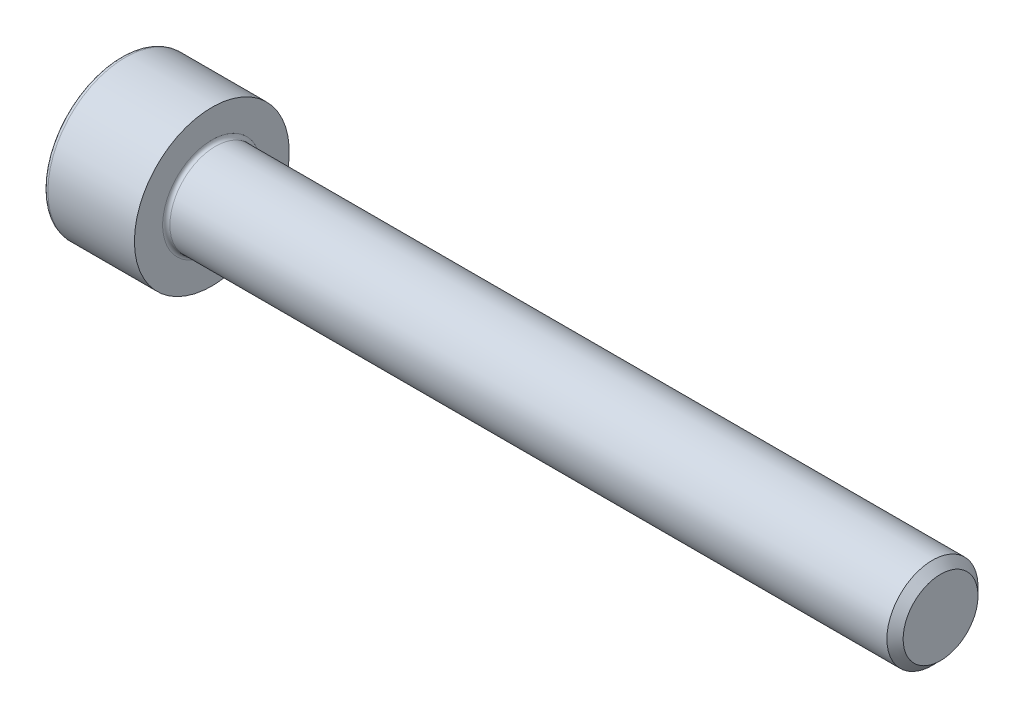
ISO-10303-21;
HEADER;
FILE_DESCRIPTION(('STEP AP214'),'2;1');
FILE_NAME('part.step','',(''),(''),'','','');
FILE_SCHEMA(('AUTOMOTIVE_DESIGN { 1 0 10303 214 1 1 1 1 }'));
ENDSEC;
DATA;
#1=APPLICATION_CONTEXT('core data for automotive mechanical design processes');
#2=APPLICATION_PROTOCOL_DEFINITION('international standard','automotive_design',2000,#1);
#3=PRODUCT_CONTEXT('',#1,'mechanical');
#4=PRODUCT('Part','Part','',(#3));
#5=PRODUCT_RELATED_PRODUCT_CATEGORY('part','',(#4));
#6=PRODUCT_DEFINITION_FORMATION('','',#4);
#7=PRODUCT_DEFINITION_CONTEXT('part definition',#1,'design');
#8=PRODUCT_DEFINITION('design','',#6,#7);
#9=PRODUCT_DEFINITION_SHAPE('','',#8);
#10=(LENGTH_UNIT() NAMED_UNIT(*) SI_UNIT(.MILLI.,.METRE.));
#11=(NAMED_UNIT(*) PLANE_ANGLE_UNIT() SI_UNIT($,.RADIAN.));
#12=(NAMED_UNIT(*) SI_UNIT($,.STERADIAN.) SOLID_ANGLE_UNIT());
#13=UNCERTAINTY_MEASURE_WITH_UNIT(LENGTH_MEASURE(1.E-05),#10,'distance_accuracy_value','');
#14=(GEOMETRIC_REPRESENTATION_CONTEXT(3) GLOBAL_UNCERTAINTY_ASSIGNED_CONTEXT((#13)) GLOBAL_UNIT_ASSIGNED_CONTEXT((#10,
#11,#12)) REPRESENTATION_CONTEXT('',''));
#15=CARTESIAN_POINT('',(0.,0.,0.));
#16=DIRECTION('',(0.,0.,1.));
#17=DIRECTION('',(1.,0.,0.));
#18=AXIS2_PLACEMENT_3D('',#15,#16,#17);
#19=CARTESIAN_POINT('',(0.,0.,0.));
#20=DIRECTION('',(-0.999999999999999,0.,0.));
#21=DIRECTION('',(0.,0.,1.));
#22=AXIS2_PLACEMENT_3D('',#19,#20,#21);
#23=PLANE('',#22);
#24=DIRECTION('',(0.,-0.499999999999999,0.86602540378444));
#25=VECTOR('',#24,1.);
#26=CARTESIAN_POINT('',(0.,2.35789849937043,0.));
#27=LINE('',#26,#25);
#28=CARTESIAN_POINT('',(0.,2.35789849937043,0.));
#29=VERTEX_POINT('',#28);
#30=CARTESIAN_POINT('',(0.,1.17894924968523,2.04199999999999));
#31=VERTEX_POINT('',#30);
#32=EDGE_CURVE('E263',#29,#31,#27,.T.);
#33=ORIENTED_EDGE('',*,*,#32,.T.);
#34=DIRECTION('',(0.,1.,0.));
#35=VECTOR('',#34,1.);
#36=CARTESIAN_POINT('',(0.,-1.17894924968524,2.04200000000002));
#37=LINE('',#36,#35);
#38=CARTESIAN_POINT('',(0.,-1.17894924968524,2.04200000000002));
#39=VERTEX_POINT('',#38);
#40=EDGE_CURVE('E124',#39,#31,#37,.T.);
#41=ORIENTED_EDGE('',*,*,#40,.F.);
#42=DIRECTION('',(0.,-0.500000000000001,-0.866025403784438));
#43=VECTOR('',#42,1.);
#44=CARTESIAN_POINT('',(0.,-1.17894924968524,2.04200000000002));
#45=LINE('',#44,#43);
#46=CARTESIAN_POINT('',(0.,-2.35789849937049,0.));
#47=VERTEX_POINT('',#46);
#48=EDGE_CURVE('E266',#39,#47,#45,.T.);
#49=ORIENTED_EDGE('',*,*,#48,.T.);
#50=DIRECTION('',(0.,0.499999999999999,-0.866025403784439));
#51=VECTOR('',#50,1.);
#52=CARTESIAN_POINT('',(0.,-2.35789849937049,0.));
#53=LINE('',#52,#51);
#54=CARTESIAN_POINT('',(0.,-1.17894924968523,-2.042));
#55=VERTEX_POINT('',#54);
#56=EDGE_CURVE('E269',#47,#55,#53,.T.);
#57=ORIENTED_EDGE('',*,*,#56,.T.);
#58=DIRECTION('',(0.,-1.,0.));
#59=VECTOR('',#58,1.);
#60=CARTESIAN_POINT('',(0.,1.1789492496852,-2.042));
#61=LINE('',#60,#59);
#62=CARTESIAN_POINT('',(0.,1.1789492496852,-2.042));
#63=VERTEX_POINT('',#62);
#64=EDGE_CURVE('E272',#63,#55,#61,.T.);
#65=ORIENTED_EDGE('',*,*,#64,.F.);
#66=DIRECTION('',(0.,-0.500000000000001,-0.866025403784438));
#67=VECTOR('',#66,1.);
#68=CARTESIAN_POINT('',(0.,2.35789849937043,0.));
#69=LINE('',#68,#67);
#70=EDGE_CURVE('E119',#29,#63,#69,.T.);
#71=ORIENTED_EDGE('',*,*,#70,.F.);
#72=EDGE_LOOP('',(#33,#41,#49,#57,#65,#71));
#73=FACE_BOUND('',#72,.T.);
#74=CARTESIAN_POINT('',(0.,0.,0.));
#75=DIRECTION('',(-0.999999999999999,0.,0.));
#76=DIRECTION('',(0.,0.,1.));
#77=AXIS2_PLACEMENT_3D('',#74,#75,#76);
#78=CIRCLE('',#77,4.);
#79=CARTESIAN_POINT('',(0.,0.,4.));
#80=VERTEX_POINT('',#79);
#81=EDGE_CURVE('E40',#80,#80,#78,.T.);
#82=ORIENTED_EDGE('',*,*,#81,.T.);
#83=EDGE_LOOP('',(#82));
#84=FACE_BOUND('',#83,.T.);
#85=ADVANCED_FACE('F32',(#73,#84),#23,.T.);
#86=CARTESIAN_POINT('',(-31.7499999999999,0.,0.));
#87=DIRECTION('',(-0.999999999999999,0.,0.));
#88=DIRECTION('',(0.,0.,1.));
#89=AXIS2_PLACEMENT_3D('',#86,#87,#88);
#90=CYLINDRICAL_SURFACE('',#89,4.25);
#91=CARTESIAN_POINT('',(0.250000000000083,0.,0.));
#92=DIRECTION('',(-0.999999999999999,0.,0.));
#93=DIRECTION('',(0.,0.,1.));
#94=AXIS2_PLACEMENT_3D('',#91,#92,#93);
#95=CIRCLE('',#94,4.25);
#96=CARTESIAN_POINT('',(0.250000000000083,0.,4.25000000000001));
#97=VERTEX_POINT('',#96);
#98=EDGE_CURVE('E11',#97,#97,#95,.F.);
#99=CARTESIAN_POINT('',(4.99999999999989,0.,0.));
#100=DIRECTION('',(-0.999999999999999,0.,0.));
#101=DIRECTION('',(0.,0.,1.));
#102=AXIS2_PLACEMENT_3D('',#99,#100,#101);
#103=CIRCLE('',#102,4.25);
#104=CARTESIAN_POINT('',(4.9999999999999,0.,4.25000000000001));
#105=VERTEX_POINT('',#104);
#106=EDGE_CURVE('E142',#105,#105,#103,.T.);
#107=CARTESIAN_POINT('',(0.250000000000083,0.,4.25000000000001));
#108=CARTESIAN_POINT('',(0.299479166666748,0.,4.25000000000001));
#109=CARTESIAN_POINT('',(0.348958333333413,0.,4.25000000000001));
#110=CARTESIAN_POINT('',(0.447916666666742,0.,4.25000000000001));
#111=CARTESIAN_POINT('',(0.497395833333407,0.,4.25000000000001));
#112=CARTESIAN_POINT('',(0.596354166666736,0.,4.25000000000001));
#113=CARTESIAN_POINT('',(0.645833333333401,0.,4.25000000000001));
#114=CARTESIAN_POINT('',(0.74479166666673,0.,4.25000000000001));
#115=CARTESIAN_POINT('',(0.794270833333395,0.,4.25000000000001));
#116=CARTESIAN_POINT('',(0.893229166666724,0.,4.25000000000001));
#117=CARTESIAN_POINT('',(0.942708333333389,0.,4.25000000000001));
#118=CARTESIAN_POINT('',(1.04166666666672,0.,4.25000000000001));
#119=CARTESIAN_POINT('',(1.09114583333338,0.,4.25000000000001));
#120=CARTESIAN_POINT('',(1.19010416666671,0.,4.25000000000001));
#121=CARTESIAN_POINT('',(1.23958333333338,0.,4.25000000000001));
#122=CARTESIAN_POINT('',(1.33854166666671,0.,4.25000000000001));
#123=CARTESIAN_POINT('',(1.38802083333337,0.,4.25000000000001));
#124=CARTESIAN_POINT('',(1.4869791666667,0.,4.25000000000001));
#125=CARTESIAN_POINT('',(1.53645833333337,0.,4.25000000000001));
#126=CARTESIAN_POINT('',(1.6354166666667,0.,4.25000000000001));
#127=CARTESIAN_POINT('',(1.68489583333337,0.,4.25000000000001));
#128=CARTESIAN_POINT('',(1.7838541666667,0.,4.25000000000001));
#129=CARTESIAN_POINT('',(1.83333333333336,0.,4.25000000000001));
#130=CARTESIAN_POINT('',(1.93229166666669,0.,4.25000000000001));
#131=CARTESIAN_POINT('',(1.98177083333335,0.,4.25000000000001));
#132=CARTESIAN_POINT('',(2.08072916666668,0.,4.25000000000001));
#133=CARTESIAN_POINT('',(2.13020833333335,0.,4.25000000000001));
#134=CARTESIAN_POINT('',(2.22916666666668,0.,4.25000000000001));
#135=CARTESIAN_POINT('',(2.27864583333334,0.,4.25000000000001));
#136=CARTESIAN_POINT('',(2.37760416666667,0.,4.25000000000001));
#137=CARTESIAN_POINT('',(2.42708333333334,0.,4.25000000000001));
#138=CARTESIAN_POINT('',(2.52604166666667,0.,4.25000000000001));
#139=CARTESIAN_POINT('',(2.57552083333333,0.,4.25000000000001));
#140=CARTESIAN_POINT('',(2.67447916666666,0.,4.25000000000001));
#141=CARTESIAN_POINT('',(2.72395833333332,0.,4.25000000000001));
#142=CARTESIAN_POINT('',(2.82291666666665,0.,4.25000000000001));
#143=CARTESIAN_POINT('',(2.87239583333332,0.,4.25000000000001));
#144=CARTESIAN_POINT('',(2.97135416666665,0.,4.25000000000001));
#145=CARTESIAN_POINT('',(3.02083333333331,0.,4.25000000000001));
#146=CARTESIAN_POINT('',(3.11979166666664,0.,4.25000000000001));
#147=CARTESIAN_POINT('',(3.16927083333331,0.,4.25000000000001));
#148=CARTESIAN_POINT('',(3.26822916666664,0.,4.25000000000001));
#149=CARTESIAN_POINT('',(3.3177083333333,0.,4.25000000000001));
#150=CARTESIAN_POINT('',(3.41666666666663,0.,4.25000000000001));
#151=CARTESIAN_POINT('',(3.46614583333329,0.,4.25000000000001));
#152=CARTESIAN_POINT('',(3.56510416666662,0.,4.25000000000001));
#153=CARTESIAN_POINT('',(3.61458333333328,0.,4.25000000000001));
#154=CARTESIAN_POINT('',(3.71354166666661,0.,4.25000000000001));
#155=CARTESIAN_POINT('',(3.76302083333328,0.,4.25000000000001));
#156=CARTESIAN_POINT('',(3.86197916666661,0.,4.25000000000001));
#157=CARTESIAN_POINT('',(3.91145833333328,0.,4.25000000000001));
#158=CARTESIAN_POINT('',(4.01041666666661,0.,4.25000000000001));
#159=CARTESIAN_POINT('',(4.05989583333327,0.,4.25000000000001));
#160=CARTESIAN_POINT('',(4.1588541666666,0.,4.25000000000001));
#161=CARTESIAN_POINT('',(4.20833333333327,0.,4.25000000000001));
#162=CARTESIAN_POINT('',(4.3072916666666,0.,4.25000000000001));
#163=CARTESIAN_POINT('',(4.35677083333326,0.,4.25000000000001));
#164=CARTESIAN_POINT('',(4.45572916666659,0.,4.25000000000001));
#165=CARTESIAN_POINT('',(4.50520833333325,0.,4.25000000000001));
#166=CARTESIAN_POINT('',(4.60416666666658,0.,4.25000000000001));
#167=CARTESIAN_POINT('',(4.65364583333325,0.,4.25000000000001));
#168=CARTESIAN_POINT('',(4.75260416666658,0.,4.25000000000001));
#169=CARTESIAN_POINT('',(4.80208333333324,0.,4.25000000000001));
#170=CARTESIAN_POINT('',(4.90104166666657,0.,4.25000000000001));
#171=CARTESIAN_POINT('',(4.95052083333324,0.,4.25000000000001));
#172=CARTESIAN_POINT('',(4.9999999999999,0.,4.25000000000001));
#173=B_SPLINE_CURVE_WITH_KNOTS('',3,(#107,#108,#109,#110,#111,#112,#113,#114,#115,#116,#117,
#118,#119,#120,#121,#122,#123,#124,#125,#126,#127,#128,#129,#130,#131,#132,#133,#134,#135,#136,
#137,#138,#139,#140,#141,#142,#143,#144,#145,#146,#147,#148,#149,#150,#151,#152,#153,#154,#155,
#156,#157,#158,#159,#160,#161,#162,#163,#164,#165,#166,#167,#168,#169,#170,#171,#172),
.UNSPECIFIED.,.F.,.F.,(4,2,2,2,2,2,2,2,2,2,2,2,2,2,2,2,2,2,2,2,2,2,2,2,2,2,2,2,2,2,2,2,4),(0.,
0.148437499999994,0.296874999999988,0.445312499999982,0.593749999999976,0.74218749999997,
0.890624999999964,1.03906249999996,1.18749999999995,1.33593749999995,1.48437499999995,
1.63281249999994,1.78124999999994,1.92968749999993,2.07812499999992,2.22656249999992,
2.37499999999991,2.52343749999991,2.6718749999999,2.82031249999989,2.96874999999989,
3.11718749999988,3.26562499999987,3.41406249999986,3.56249999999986,3.71093749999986,
3.85937499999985,4.00781249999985,4.15624999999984,4.30468749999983,4.45312499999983,
4.60156249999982,4.74999999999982),.UNSPECIFIED.);
#174=EDGE_CURVE('BSEAM166',#97,#105,#173,.T.);
#175=ORIENTED_EDGE('',*,*,#98,.T.);
#176=ORIENTED_EDGE('',*,*,#106,.T.);
#177=ORIENTED_EDGE('',*,*,#174,.T.);
#178=ORIENTED_EDGE('',*,*,#174,.F.);
#179=EDGE_LOOP('',(#175,#177,#176,#178));
#180=FACE_BOUND('',#179,.T.);
#181=ADVANCED_FACE('F166',(#180),#90,.T.);
#182=CARTESIAN_POINT('',(5.00000000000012,4.25,0.));
#183=DIRECTION('',(0.999999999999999,0.,0.));
#184=DIRECTION('',(0.,0.,-1.));
#185=AXIS2_PLACEMENT_3D('',#182,#183,#184);
#186=PLANE('',#185);
#187=CARTESIAN_POINT('',(4.99999999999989,0.,0.));
#188=DIRECTION('',(0.999999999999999,0.,0.));
#189=DIRECTION('',(0.,0.,-1.));
#190=AXIS2_PLACEMENT_3D('',#187,#188,#189);
#191=CIRCLE('',#190,2.7);
#192=CARTESIAN_POINT('',(4.99999999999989,0.,-2.70000000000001));
#193=VERTEX_POINT('',#192);
#194=EDGE_CURVE('E145',#193,#193,#191,.F.);
#195=ORIENTED_EDGE('',*,*,#194,.T.);
#196=EDGE_LOOP('',(#195));
#197=FACE_BOUND('',#196,.T.);
#198=ORIENTED_EDGE('',*,*,#106,.F.);
#199=EDGE_LOOP('',(#198));
#200=FACE_BOUND('',#199,.T.);
#201=ADVANCED_FACE('F172',(#197,#200),#186,.T.);
#202=CARTESIAN_POINT('',(-31.7499999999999,0.,0.));
#203=DIRECTION('',(-0.999999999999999,0.,0.));
#204=DIRECTION('',(0.,0.,1.));
#205=AXIS2_PLACEMENT_3D('',#202,#203,#204);
#206=CYLINDRICAL_SURFACE('',#205,2.5);
#207=CARTESIAN_POINT('',(5.20000000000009,0.,0.));
#208=DIRECTION('',(0.999999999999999,0.,0.));
#209=DIRECTION('',(0.,0.,-1.));
#210=AXIS2_PLACEMENT_3D('',#207,#208,#209);
#211=CIRCLE('',#210,2.5);
#212=CARTESIAN_POINT('',(5.2000000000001,0.,2.50000000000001));
#213=VERTEX_POINT('',#212);
#214=EDGE_CURVE('E148',#213,#213,#211,.T.);
#215=CARTESIAN_POINT('',(44.5549999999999,0.,0.));
#216=DIRECTION('',(-0.999999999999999,0.,0.));
#217=DIRECTION('',(0.,0.,1.));
#218=AXIS2_PLACEMENT_3D('',#215,#216,#217);
#219=CIRCLE('',#218,2.5);
#220=CARTESIAN_POINT('',(44.5549999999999,0.,2.50000000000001));
#221=VERTEX_POINT('',#220);
#222=EDGE_CURVE('E139',#221,#221,#219,.T.);
#223=CARTESIAN_POINT('',(5.2000000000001,0.,2.50000000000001));
#224=CARTESIAN_POINT('',(5.60994791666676,0.,2.50000000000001));
#225=CARTESIAN_POINT('',(6.01989583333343,0.,2.50000000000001));
#226=CARTESIAN_POINT('',(6.83979166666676,0.,2.50000000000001));
#227=CARTESIAN_POINT('',(7.24973958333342,0.,2.50000000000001));
#228=CARTESIAN_POINT('',(8.06963541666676,0.,2.50000000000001));
#229=CARTESIAN_POINT('',(8.47958333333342,0.,2.50000000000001));
#230=CARTESIAN_POINT('',(9.29947916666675,0.,2.50000000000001));
#231=CARTESIAN_POINT('',(9.70942708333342,0.,2.50000000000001));
#232=CARTESIAN_POINT('',(10.5293229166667,0.,2.50000000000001));
#233=CARTESIAN_POINT('',(10.9392708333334,0.,2.50000000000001));
#234=CARTESIAN_POINT('',(11.7591666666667,0.,2.50000000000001));
#235=CARTESIAN_POINT('',(12.1691145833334,0.,2.50000000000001));
#236=CARTESIAN_POINT('',(12.9890104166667,0.,2.50000000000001));
#237=CARTESIAN_POINT('',(13.3989583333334,0.,2.50000000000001));
#238=CARTESIAN_POINT('',(14.2188541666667,0.,2.50000000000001));
#239=CARTESIAN_POINT('',(14.6288020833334,0.,2.50000000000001));
#240=CARTESIAN_POINT('',(15.4486979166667,0.,2.50000000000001));
#241=CARTESIAN_POINT('',(15.8586458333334,0.,2.50000000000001));
#242=CARTESIAN_POINT('',(16.6785416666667,0.,2.50000000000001));
#243=CARTESIAN_POINT('',(17.0884895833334,0.,2.50000000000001));
#244=CARTESIAN_POINT('',(17.9083854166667,0.,2.50000000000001));
#245=CARTESIAN_POINT('',(18.3183333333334,0.,2.50000000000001));
#246=CARTESIAN_POINT('',(19.1382291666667,0.,2.50000000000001));
#247=CARTESIAN_POINT('',(19.5481770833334,0.,2.50000000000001));
#248=CARTESIAN_POINT('',(20.3680729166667,0.,2.50000000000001));
#249=CARTESIAN_POINT('',(20.7780208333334,0.,2.50000000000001));
#250=CARTESIAN_POINT('',(21.5979166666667,0.,2.50000000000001));
#251=CARTESIAN_POINT('',(22.0078645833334,0.,2.50000000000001));
#252=CARTESIAN_POINT('',(22.8277604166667,0.,2.50000000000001));
#253=CARTESIAN_POINT('',(23.2377083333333,0.,2.50000000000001));
#254=CARTESIAN_POINT('',(24.0576041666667,0.,2.50000000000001));
#255=CARTESIAN_POINT('',(24.4675520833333,0.,2.50000000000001));
#256=CARTESIAN_POINT('',(25.2874479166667,0.,2.50000000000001));
#257=CARTESIAN_POINT('',(25.6973958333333,0.,2.50000000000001));
#258=CARTESIAN_POINT('',(26.5172916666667,0.,2.50000000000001));
#259=CARTESIAN_POINT('',(26.9272395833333,0.,2.50000000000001));
#260=CARTESIAN_POINT('',(27.7471354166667,0.,2.50000000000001));
#261=CARTESIAN_POINT('',(28.1570833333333,0.,2.50000000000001));
#262=CARTESIAN_POINT('',(28.9769791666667,0.,2.50000000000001));
#263=CARTESIAN_POINT('',(29.3869270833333,0.,2.50000000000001));
#264=CARTESIAN_POINT('',(30.2068229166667,0.,2.50000000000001));
#265=CARTESIAN_POINT('',(30.6167708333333,0.,2.50000000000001));
#266=CARTESIAN_POINT('',(31.4366666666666,0.,2.50000000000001));
#267=CARTESIAN_POINT('',(31.8466145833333,0.,2.50000000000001));
#268=CARTESIAN_POINT('',(32.6665104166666,0.,2.50000000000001));
#269=CARTESIAN_POINT('',(33.0764583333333,0.,2.50000000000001));
#270=CARTESIAN_POINT('',(33.8963541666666,0.,2.50000000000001));
#271=CARTESIAN_POINT('',(34.3063020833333,0.,2.50000000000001));
#272=CARTESIAN_POINT('',(35.1261979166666,0.,2.50000000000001));
#273=CARTESIAN_POINT('',(35.5361458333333,0.,2.50000000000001));
#274=CARTESIAN_POINT('',(36.3560416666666,0.,2.50000000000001));
#275=CARTESIAN_POINT('',(36.7659895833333,0.,2.50000000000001));
#276=CARTESIAN_POINT('',(37.5858854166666,0.,2.50000000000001));
#277=CARTESIAN_POINT('',(37.9958333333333,0.,2.50000000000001));
#278=CARTESIAN_POINT('',(38.8157291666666,0.,2.50000000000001));
#279=CARTESIAN_POINT('',(39.2256770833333,0.,2.50000000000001));
#280=CARTESIAN_POINT('',(40.0455729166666,0.,2.50000000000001));
#281=CARTESIAN_POINT('',(40.4555208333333,0.,2.50000000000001));
#282=CARTESIAN_POINT('',(41.2754166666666,0.,2.50000000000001));
#283=CARTESIAN_POINT('',(41.6853645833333,0.,2.50000000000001));
#284=CARTESIAN_POINT('',(42.5052604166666,0.,2.50000000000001));
#285=CARTESIAN_POINT('',(42.9152083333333,0.,2.50000000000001));
#286=CARTESIAN_POINT('',(43.7351041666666,0.,2.50000000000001));
#287=CARTESIAN_POINT('',(44.1450520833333,0.,2.50000000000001));
#288=CARTESIAN_POINT('',(44.5549999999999,0.,2.50000000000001));
#289=B_SPLINE_CURVE_WITH_KNOTS('',3,(#223,#224,#225,#226,#227,#228,#229,#230,#231,#232,#233,
#234,#235,#236,#237,#238,#239,#240,#241,#242,#243,#244,#245,#246,#247,#248,#249,#250,#251,#252,
#253,#254,#255,#256,#257,#258,#259,#260,#261,#262,#263,#264,#265,#266,#267,#268,#269,#270,#271,
#272,#273,#274,#275,#276,#277,#278,#279,#280,#281,#282,#283,#284,#285,#286,#287,#288),
.UNSPECIFIED.,.F.,.F.,(4,2,2,2,2,2,2,2,2,2,2,2,2,2,2,2,2,2,2,2,2,2,2,2,2,2,2,2,2,2,2,2,4),(0.,
1.22984374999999,2.45968749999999,3.68953124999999,4.91937499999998,6.14921874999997,
7.37906249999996,8.60890624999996,9.83874999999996,11.06859375,12.2984374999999,
13.5282812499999,14.7581249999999,15.9879687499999,17.2178124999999,18.4476562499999,
19.6774999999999,20.9073437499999,22.1371874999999,23.3670312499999,24.5968749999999,
25.8267187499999,27.0565624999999,28.2864062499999,29.5162499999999,30.7460937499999,
31.9759374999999,33.2057812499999,34.4356249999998,35.6654687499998,36.8953124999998,
38.1251562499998,39.3549999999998),.UNSPECIFIED.);
#290=EDGE_CURVE('BSEAM178',#213,#221,#289,.T.);
#291=ORIENTED_EDGE('',*,*,#214,.T.);
#292=ORIENTED_EDGE('',*,*,#222,.T.);
#293=ORIENTED_EDGE('',*,*,#290,.T.);
#294=ORIENTED_EDGE('',*,*,#290,.F.);
#295=EDGE_LOOP('',(#291,#293,#292,#294));
#296=FACE_BOUND('',#295,.T.);
#297=ADVANCED_FACE('F178',(#296),#206,.T.);
#298=CARTESIAN_POINT('',(44.9999999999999,0.,0.));
#299=DIRECTION('',(-0.999999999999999,0.,0.));
#300=DIRECTION('',(0.,0.,1.));
#301=AXIS2_PLACEMENT_3D('',#298,#299,#300);
#302=CONICAL_SURFACE('',#301,2.055,0.785398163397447);
#303=CARTESIAN_POINT('',(44.9999999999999,0.,0.));
#304=DIRECTION('',(-0.999999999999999,0.,0.));
#305=DIRECTION('',(0.,0.,1.));
#306=AXIS2_PLACEMENT_3D('',#303,#304,#305);
#307=CIRCLE('',#306,2.055);
#308=CARTESIAN_POINT('',(44.9999999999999,0.,2.055));
#309=VERTEX_POINT('',#308);
#310=EDGE_CURVE('E135',#309,#309,#307,.T.);
#311=CARTESIAN_POINT('',(44.5549999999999,0.,2.50000000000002));
#312=CARTESIAN_POINT('',(44.5596354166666,0.,2.49536458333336));
#313=CARTESIAN_POINT('',(44.5642708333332,0.,2.49072916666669));
#314=CARTESIAN_POINT('',(44.5735416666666,0.,2.48145833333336));
#315=CARTESIAN_POINT('',(44.5781770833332,0.,2.47682291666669));
#316=CARTESIAN_POINT('',(44.5874479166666,0.,2.46755208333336));
#317=CARTESIAN_POINT('',(44.5920833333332,0.,2.46291666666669));
#318=CARTESIAN_POINT('',(44.6013541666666,0.,2.45364583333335));
#319=CARTESIAN_POINT('',(44.6059895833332,0.,2.44901041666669));
#320=CARTESIAN_POINT('',(44.6152604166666,0.,2.43973958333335));
#321=CARTESIAN_POINT('',(44.6198958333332,0.,2.43510416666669));
#322=CARTESIAN_POINT('',(44.6291666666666,0.,2.42583333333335));
#323=CARTESIAN_POINT('',(44.6338020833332,0.,2.42119791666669));
#324=CARTESIAN_POINT('',(44.6430729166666,0.,2.41192708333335));
#325=CARTESIAN_POINT('',(44.6477083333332,0.,2.40729166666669));
#326=CARTESIAN_POINT('',(44.6569791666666,0.,2.39802083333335));
#327=CARTESIAN_POINT('',(44.6616145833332,0.,2.39338541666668));
#328=CARTESIAN_POINT('',(44.6708854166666,0.,2.38411458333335));
#329=CARTESIAN_POINT('',(44.6755208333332,0.,2.37947916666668));
#330=CARTESIAN_POINT('',(44.6847916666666,0.,2.37020833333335));
#331=CARTESIAN_POINT('',(44.6894270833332,0.,2.36557291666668));
#332=CARTESIAN_POINT('',(44.6986979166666,0.,2.35630208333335));
#333=CARTESIAN_POINT('',(44.7033333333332,0.,2.35166666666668));
#334=CARTESIAN_POINT('',(44.7126041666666,0.,2.34239583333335));
#335=CARTESIAN_POINT('',(44.7172395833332,0.,2.33776041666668));
#336=CARTESIAN_POINT('',(44.7265104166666,0.,2.32848958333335));
#337=CARTESIAN_POINT('',(44.7311458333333,0.,2.32385416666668));
#338=CARTESIAN_POINT('',(44.7404166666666,0.,2.31458333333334));
#339=CARTESIAN_POINT('',(44.7450520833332,0.,2.30994791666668));
#340=CARTESIAN_POINT('',(44.7543229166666,0.,2.30067708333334));
#341=CARTESIAN_POINT('',(44.7589583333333,0.,2.29604166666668));
#342=CARTESIAN_POINT('',(44.7682291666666,0.,2.28677083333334));
#343=CARTESIAN_POINT('',(44.7728645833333,0.,2.28213541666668));
#344=CARTESIAN_POINT('',(44.7821354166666,0.,2.27286458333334));
#345=CARTESIAN_POINT('',(44.7867708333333,0.,2.26822916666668));
#346=CARTESIAN_POINT('',(44.7960416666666,0.,2.25895833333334));
#347=CARTESIAN_POINT('',(44.8006770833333,0.,2.25432291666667));
#348=CARTESIAN_POINT('',(44.8099479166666,0.,2.24505208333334));
#349=CARTESIAN_POINT('',(44.8145833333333,0.,2.24041666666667));
#350=CARTESIAN_POINT('',(44.8238541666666,0.,2.23114583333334));
#351=CARTESIAN_POINT('',(44.8284895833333,0.,2.22651041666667));
#352=CARTESIAN_POINT('',(44.8377604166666,0.,2.21723958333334));
#353=CARTESIAN_POINT('',(44.8423958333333,0.,2.21260416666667));
#354=CARTESIAN_POINT('',(44.8516666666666,0.,2.20333333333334));
#355=CARTESIAN_POINT('',(44.8563020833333,0.,2.19869791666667));
#356=CARTESIAN_POINT('',(44.8655729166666,0.,2.18942708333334));
#357=CARTESIAN_POINT('',(44.8702083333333,0.,2.18479166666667));
#358=CARTESIAN_POINT('',(44.8794791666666,0.,2.17552083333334));
#359=CARTESIAN_POINT('',(44.8841145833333,0.,2.17088541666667));
#360=CARTESIAN_POINT('',(44.8933854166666,0.,2.16161458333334));
#361=CARTESIAN_POINT('',(44.8980208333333,0.,2.15697916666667));
#362=CARTESIAN_POINT('',(44.9072916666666,0.,2.14770833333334));
#363=CARTESIAN_POINT('',(44.9119270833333,0.,2.14307291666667));
#364=CARTESIAN_POINT('',(44.9211979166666,0.,2.13380208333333));
#365=CARTESIAN_POINT('',(44.9258333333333,0.,2.12916666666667));
#366=CARTESIAN_POINT('',(44.9351041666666,0.,2.11989583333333));
#367=CARTESIAN_POINT('',(44.9397395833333,0.,2.11526041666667));
#368=CARTESIAN_POINT('',(44.9490104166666,0.,2.10598958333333));
#369=CARTESIAN_POINT('',(44.9536458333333,0.,2.10135416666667));
#370=CARTESIAN_POINT('',(44.9629166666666,0.,2.09208333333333));
#371=CARTESIAN_POINT('',(44.9675520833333,0.,2.08744791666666));
#372=CARTESIAN_POINT('',(44.9768229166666,0.,2.07817708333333));
#373=CARTESIAN_POINT('',(44.9814583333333,0.,2.07354166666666));
#374=CARTESIAN_POINT('',(44.9907291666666,0.,2.06427083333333));
#375=CARTESIAN_POINT('',(44.9953645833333,0.,2.05963541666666));
#376=CARTESIAN_POINT('',(44.9999999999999,0.,2.055));
#377=B_SPLINE_CURVE_WITH_KNOTS('',3,(#311,#312,#313,#314,#315,#316,#317,#318,#319,#320,#321,
#322,#323,#324,#325,#326,#327,#328,#329,#330,#331,#332,#333,#334,#335,#336,#337,#338,#339,#340,
#341,#342,#343,#344,#345,#346,#347,#348,#349,#350,#351,#352,#353,#354,#355,#356,#357,#358,#359,
#360,#361,#362,#363,#364,#365,#366,#367,#368,#369,#370,#371,#372,#373,#374,#375,#376),
.UNSPECIFIED.,.F.,.F.,(4,2,2,2,2,2,2,2,2,2,2,2,2,2,2,2,2,2,2,2,2,2,2,2,2,2,2,2,2,2,2,2,4),(0.,
0.0196664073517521,0.0393328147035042,0.0589992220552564,0.0786656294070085,0.0983320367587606,
0.117998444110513,0.137664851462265,0.157331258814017,0.176997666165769,0.196664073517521,
0.216330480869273,0.235996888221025,0.255663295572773,0.275329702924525,0.294996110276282,
0.314662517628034,0.334328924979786,0.353995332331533,0.37366173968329,0.393328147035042,
0.412994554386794,0.432660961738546,0.452327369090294,0.471993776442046,0.491660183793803,
0.511326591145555,0.530992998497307,0.550659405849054,0.570325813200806,0.589992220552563,
0.609658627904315,0.629325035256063),.UNSPECIFIED.);
#378=EDGE_CURVE('BSEAM182',#221,#309,#377,.T.);
#379=ORIENTED_EDGE('',*,*,#222,.F.);
#380=ORIENTED_EDGE('',*,*,#310,.T.);
#381=ORIENTED_EDGE('',*,*,#378,.T.);
#382=ORIENTED_EDGE('',*,*,#378,.F.);
#383=EDGE_LOOP('',(#379,#381,#380,#382));
#384=FACE_BOUND('',#383,.T.);
#385=ADVANCED_FACE('F182',(#384),#302,.T.);
#386=CARTESIAN_POINT('',(44.9999999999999,2.055,0.));
#387=DIRECTION('',(0.999999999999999,0.,0.));
#388=DIRECTION('',(0.,0.,-1.));
#389=AXIS2_PLACEMENT_3D('',#386,#387,#388);
#390=PLANE('',#389);
#391=ORIENTED_EDGE('',*,*,#310,.F.);
#392=EDGE_LOOP('',(#391));
#393=FACE_BOUND('',#392,.T.);
#394=ADVANCED_FACE('F162',(#393),#390,.T.);
#395=CARTESIAN_POINT('',(5.20000000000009,0.,0.));
#396=DIRECTION('',(0.999999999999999,0.,0.));
#397=DIRECTION('',(0.,0.,-1.));
#398=AXIS2_PLACEMENT_3D('',#395,#396,#397);
#399=TOROIDAL_SURFACE('',#398,2.7,0.2);
#400=ORIENTED_EDGE('',*,*,#214,.F.);
#401=EDGE_LOOP('',(#400));
#402=FACE_BOUND('',#401,.T.);
#403=ORIENTED_EDGE('',*,*,#194,.F.);
#404=EDGE_LOOP('',(#403));
#405=FACE_BOUND('',#404,.T.);
#406=ADVANCED_FACE('F155',(#402,#405),#399,.F.);
#407=CARTESIAN_POINT('',(0.250000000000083,0.,0.));
#408=DIRECTION('',(-0.999999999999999,0.,0.));
#409=DIRECTION('',(0.,0.,1.));
#410=AXIS2_PLACEMENT_3D('',#407,#408,#409);
#411=TOROIDAL_SURFACE('',#410,4.,0.25);
#412=ORIENTED_EDGE('',*,*,#98,.F.);
#413=EDGE_LOOP('',(#412));
#414=FACE_BOUND('',#413,.T.);
#415=ORIENTED_EDGE('',*,*,#81,.F.);
#416=EDGE_LOOP('',(#415));
#417=FACE_BOUND('',#416,.T.);
#418=ADVANCED_FACE('F34',(#414,#417),#411,.T.);
#419=CARTESIAN_POINT('',(2.49999999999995,2.35789849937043,0.));
#420=DIRECTION('',(0.,-0.86602540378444,-0.499999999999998));
#421=DIRECTION('',(0.,0.499999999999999,-0.86602540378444));
#422=AXIS2_PLACEMENT_3D('',#419,#420,#421);
#423=PLANE('',#422);
#424=ORIENTED_EDGE('',*,*,#32,.F.);
#425=DIRECTION('',(-0.999999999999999,0.,0.));
#426=VECTOR('',#425,1.);
#427=CARTESIAN_POINT('',(2.49999999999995,2.35789849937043,0.));
#428=LINE('',#427,#426);
#429=CARTESIAN_POINT('',(2.49999999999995,2.35789849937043,0.));
#430=VERTEX_POINT('',#429);
#431=EDGE_CURVE('E262',#430,#29,#428,.T.);
#432=ORIENTED_EDGE('',*,*,#431,.F.);
#433=DIRECTION('',(0.,-0.499999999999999,0.86602540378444));
#434=VECTOR('',#433,1.);
#435=CARTESIAN_POINT('',(2.49999999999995,2.35789849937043,0.));
#436=LINE('',#435,#434);
#437=CARTESIAN_POINT('',(2.49999999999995,1.76842387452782,1.02099999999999));
#438=VERTEX_POINT('',#437);
#439=EDGE_CURVE('E47',#430,#438,#436,.T.);
#440=ORIENTED_EDGE('',*,*,#439,.T.);
#441=CARTESIAN_POINT('',(2.49999999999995,1.17894924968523,2.04199999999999));
#442=VERTEX_POINT('',#441);
#443=EDGE_CURVE('E105',#438,#442,#436,.T.);
#444=ORIENTED_EDGE('',*,*,#443,.T.);
#445=DIRECTION('',(-0.999999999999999,0.,0.));
#446=VECTOR('',#445,1.);
#447=CARTESIAN_POINT('',(2.49999999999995,1.17894924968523,2.04199999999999));
#448=LINE('',#447,#446);
#449=EDGE_CURVE('E117',#442,#31,#448,.T.);
#450=ORIENTED_EDGE('',*,*,#449,.T.);
#451=EDGE_LOOP('',(#424,#432,#440,#444,#450));
#452=FACE_BOUND('',#451,.T.);
#453=ADVANCED_FACE('F116',(#452),#423,.T.);
#454=CARTESIAN_POINT('',(2.49999999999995,-1.17894924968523,2.042));
#455=DIRECTION('',(0.,0.,1.));
#456=DIRECTION('',(0.,-1.,0.));
#457=AXIS2_PLACEMENT_3D('',#454,#455,#456);
#458=PLANE('',#457);
#459=ORIENTED_EDGE('',*,*,#40,.T.);
#460=ORIENTED_EDGE('',*,*,#449,.F.);
#461=DIRECTION('',(0.,1.,0.));
#462=VECTOR('',#461,1.);
#463=CARTESIAN_POINT('',(2.49999999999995,-1.17894924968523,2.042));
#464=LINE('',#463,#462);
#465=CARTESIAN_POINT('',(2.49999999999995,0.,2.04199999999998));
#466=VERTEX_POINT('',#465);
#467=EDGE_CURVE('E103',#466,#442,#464,.T.);
#468=ORIENTED_EDGE('',*,*,#467,.F.);
#469=CARTESIAN_POINT('',(2.49999999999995,-1.17894924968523,2.042));
#470=VERTEX_POINT('',#469);
#471=EDGE_CURVE('E113',#470,#466,#464,.T.);
#472=ORIENTED_EDGE('',*,*,#471,.F.);
#473=DIRECTION('',(-0.999999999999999,0.,0.));
#474=VECTOR('',#473,1.);
#475=CARTESIAN_POINT('',(2.49999999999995,-1.17894924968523,2.042));
#476=LINE('',#475,#474);
#477=EDGE_CURVE('E126',#470,#39,#476,.T.);
#478=ORIENTED_EDGE('',*,*,#477,.T.);
#479=EDGE_LOOP('',(#459,#460,#468,#472,#478));
#480=FACE_BOUND('',#479,.T.);
#481=ADVANCED_FACE('F121',(#480),#458,.F.);
#482=CARTESIAN_POINT('',(2.49999999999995,-1.17894924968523,2.042));
#483=DIRECTION('',(0.,0.866025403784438,-0.500000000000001));
#484=DIRECTION('',(0.,0.500000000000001,0.866025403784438));
#485=AXIS2_PLACEMENT_3D('',#482,#483,#484);
#486=PLANE('',#485);
#487=ORIENTED_EDGE('',*,*,#48,.F.);
#488=ORIENTED_EDGE('',*,*,#477,.F.);
#489=DIRECTION('',(0.,-0.500000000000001,-0.866025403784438));
#490=VECTOR('',#489,1.);
#491=CARTESIAN_POINT('',(2.49999999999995,-1.17894924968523,2.042));
#492=LINE('',#491,#490);
#493=CARTESIAN_POINT('',(2.49999999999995,-1.7684238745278,1.02100000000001));
#494=VERTEX_POINT('',#493);
#495=EDGE_CURVE('E243',#470,#494,#492,.T.);
#496=ORIENTED_EDGE('',*,*,#495,.T.);
#497=CARTESIAN_POINT('',(2.49999999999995,-2.35789849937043,0.));
#498=VERTEX_POINT('',#497);
#499=EDGE_CURVE('E245',#494,#498,#492,.T.);
#500=ORIENTED_EDGE('',*,*,#499,.T.);
#501=DIRECTION('',(-0.999999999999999,0.,0.));
#502=VECTOR('',#501,1.);
#503=CARTESIAN_POINT('',(2.49999999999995,-2.35789849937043,0.));
#504=LINE('',#503,#502);
#505=EDGE_CURVE('E131',#498,#47,#504,.T.);
#506=ORIENTED_EDGE('',*,*,#505,.T.);
#507=EDGE_LOOP('',(#487,#488,#496,#500,#506));
#508=FACE_BOUND('',#507,.T.);
#509=ADVANCED_FACE('F195',(#508),#486,.T.);
#510=CARTESIAN_POINT('',(2.49999999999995,-2.35789849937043,0.));
#511=DIRECTION('',(0.,0.866025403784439,0.499999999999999));
#512=DIRECTION('',(0.,-0.499999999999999,0.86602540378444));
#513=AXIS2_PLACEMENT_3D('',#510,#511,#512);
#514=PLANE('',#513);
#515=ORIENTED_EDGE('',*,*,#56,.F.);
#516=ORIENTED_EDGE('',*,*,#505,.F.);
#517=DIRECTION('',(0.,0.499999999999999,-0.866025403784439));
#518=VECTOR('',#517,1.);
#519=CARTESIAN_POINT('',(2.49999999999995,-2.35789849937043,0.));
#520=LINE('',#519,#518);
#521=CARTESIAN_POINT('',(2.49999999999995,-1.76842387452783,-1.02100000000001));
#522=VERTEX_POINT('',#521);
#523=EDGE_CURVE('E248',#498,#522,#520,.T.);
#524=ORIENTED_EDGE('',*,*,#523,.T.);
#525=CARTESIAN_POINT('',(2.49999999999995,-1.17894924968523,-2.042));
#526=VERTEX_POINT('',#525);
#527=EDGE_CURVE('E252',#522,#526,#520,.T.);
#528=ORIENTED_EDGE('',*,*,#527,.T.);
#529=DIRECTION('',(-0.999999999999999,0.,0.));
#530=VECTOR('',#529,1.);
#531=CARTESIAN_POINT('',(2.49999999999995,-1.17894924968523,-2.042));
#532=LINE('',#531,#530);
#533=EDGE_CURVE('E281',#526,#55,#532,.T.);
#534=ORIENTED_EDGE('',*,*,#533,.T.);
#535=EDGE_LOOP('',(#515,#516,#524,#528,#534));
#536=FACE_BOUND('',#535,.T.);
#537=ADVANCED_FACE('F198',(#536),#514,.T.);
#538=CARTESIAN_POINT('',(2.49999999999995,1.1789492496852,-2.04200000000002));
#539=DIRECTION('',(0.,0.,-1.));
#540=DIRECTION('',(0.,1.,0.));
#541=AXIS2_PLACEMENT_3D('',#538,#539,#540);
#542=PLANE('',#541);
#543=ORIENTED_EDGE('',*,*,#64,.T.);
#544=ORIENTED_EDGE('',*,*,#533,.F.);
#545=DIRECTION('',(0.,-1.,0.));
#546=VECTOR('',#545,1.);
#547=CARTESIAN_POINT('',(2.49999999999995,1.1789492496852,-2.04200000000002));
#548=LINE('',#547,#546);
#549=CARTESIAN_POINT('',(2.49999999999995,0.,-2.04199999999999));
#550=VERTEX_POINT('',#549);
#551=EDGE_CURVE('E256',#550,#526,#548,.T.);
#552=ORIENTED_EDGE('',*,*,#551,.F.);
#553=CARTESIAN_POINT('',(2.49999999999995,1.1789492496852,-2.04200000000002));
#554=VERTEX_POINT('',#553);
#555=EDGE_CURVE('E257',#554,#550,#548,.T.);
#556=ORIENTED_EDGE('',*,*,#555,.F.);
#557=DIRECTION('',(-0.999999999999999,0.,0.));
#558=VECTOR('',#557,1.);
#559=CARTESIAN_POINT('',(2.49999999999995,1.1789492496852,-2.04200000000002));
#560=LINE('',#559,#558);
#561=EDGE_CURVE('E278',#554,#63,#560,.T.);
#562=ORIENTED_EDGE('',*,*,#561,.T.);
#563=EDGE_LOOP('',(#543,#544,#552,#556,#562));
#564=FACE_BOUND('',#563,.T.);
#565=ADVANCED_FACE('F202',(#564),#542,.F.);
#566=CARTESIAN_POINT('',(2.49999999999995,2.35789849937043,0.));
#567=DIRECTION('',(0.,0.866025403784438,-0.500000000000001));
#568=DIRECTION('',(0.,0.500000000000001,0.866025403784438));
#569=AXIS2_PLACEMENT_3D('',#566,#567,#568);
#570=PLANE('',#569);
#571=ORIENTED_EDGE('',*,*,#70,.T.);
#572=ORIENTED_EDGE('',*,*,#561,.F.);
#573=DIRECTION('',(0.,-0.500000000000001,-0.866025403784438));
#574=VECTOR('',#573,1.);
#575=CARTESIAN_POINT('',(2.49999999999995,2.35789849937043,0.));
#576=LINE('',#575,#574);
#577=CARTESIAN_POINT('',(2.49999999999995,1.7684238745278,-1.02100000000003));
#578=VERTEX_POINT('',#577);
#579=EDGE_CURVE('E260',#578,#554,#576,.T.);
#580=ORIENTED_EDGE('',*,*,#579,.F.);
#581=EDGE_CURVE('E234',#430,#578,#576,.T.);
#582=ORIENTED_EDGE('',*,*,#581,.F.);
#583=ORIENTED_EDGE('',*,*,#431,.T.);
#584=EDGE_LOOP('',(#571,#572,#580,#582,#583));
#585=FACE_BOUND('',#584,.T.);
#586=ADVANCED_FACE('F206',(#585),#570,.F.);
#587=CARTESIAN_POINT('',(2.49999999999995,1.17894924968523,2.04199999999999));
#588=DIRECTION('',(-0.999999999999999,0.,0.));
#589=DIRECTION('',(0.,0.,1.));
#590=AXIS2_PLACEMENT_3D('',#587,#588,#589);
#591=PLANE('',#590);
#592=CARTESIAN_POINT('',(2.49999999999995,0.,0.));
#593=DIRECTION('',(-0.999999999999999,0.,0.));
#594=DIRECTION('',(0.,0.,1.));
#595=AXIS2_PLACEMENT_3D('',#592,#593,#594);
#596=CIRCLE('',#595,2.042);
#597=EDGE_CURVE('E125',#494,#466,#596,.T.);
#598=ORIENTED_EDGE('',*,*,#597,.F.);
#599=ORIENTED_EDGE('',*,*,#495,.F.);
#600=ORIENTED_EDGE('',*,*,#471,.T.);
#601=EDGE_LOOP('',(#598,#599,#600));
#602=FACE_BOUND('',#601,.T.);
#603=ADVANCED_FACE('F210',(#602),#591,.T.);
#604=EDGE_CURVE('E129',#522,#494,#596,.T.);
#605=ORIENTED_EDGE('',*,*,#604,.F.);
#606=ORIENTED_EDGE('',*,*,#523,.F.);
#607=ORIENTED_EDGE('',*,*,#499,.F.);
#608=EDGE_LOOP('',(#605,#606,#607));
#609=FACE_BOUND('',#608,.T.);
#610=ADVANCED_FACE('F213',(#609),#591,.T.);
#611=EDGE_CURVE('E287',#550,#522,#596,.T.);
#612=ORIENTED_EDGE('',*,*,#611,.F.);
#613=ORIENTED_EDGE('',*,*,#551,.T.);
#614=ORIENTED_EDGE('',*,*,#527,.F.);
#615=EDGE_LOOP('',(#612,#613,#614));
#616=FACE_BOUND('',#615,.T.);
#617=ADVANCED_FACE('F218',(#616),#591,.T.);
#618=EDGE_CURVE('E237',#578,#550,#596,.T.);
#619=ORIENTED_EDGE('',*,*,#618,.F.);
#620=ORIENTED_EDGE('',*,*,#579,.T.);
#621=ORIENTED_EDGE('',*,*,#555,.T.);
#622=EDGE_LOOP('',(#619,#620,#621));
#623=FACE_BOUND('',#622,.T.);
#624=ADVANCED_FACE('F225',(#623),#591,.T.);
#625=EDGE_CURVE('E136',#438,#578,#596,.T.);
#626=ORIENTED_EDGE('',*,*,#625,.F.);
#627=ORIENTED_EDGE('',*,*,#439,.F.);
#628=ORIENTED_EDGE('',*,*,#581,.T.);
#629=EDGE_LOOP('',(#626,#627,#628));
#630=FACE_BOUND('',#629,.T.);
#631=ADVANCED_FACE('F221',(#630),#591,.T.);
#632=EDGE_CURVE('E108',#466,#438,#596,.T.);
#633=ORIENTED_EDGE('',*,*,#632,.F.);
#634=ORIENTED_EDGE('',*,*,#467,.T.);
#635=ORIENTED_EDGE('',*,*,#443,.F.);
#636=EDGE_LOOP('',(#633,#634,#635));
#637=FACE_BOUND('',#636,.T.);
#638=ADVANCED_FACE('F104',(#637),#591,.T.);
#639=CARTESIAN_POINT('',(2.49999999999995,0.,0.));
#640=DIRECTION('',(-0.999999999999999,0.,0.));
#641=DIRECTION('',(0.,0.,1.));
#642=AXIS2_PLACEMENT_3D('',#639,#640,#641);
#643=CONICAL_SURFACE('',#642,2.042,1.04719755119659);
#644=CARTESIAN_POINT('',(3.67894924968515,0.,0.));
#645=VERTEX_POINT('',#644);
#646=VERTEX_LOOP('',#645);
#647=FACE_BOUND('',#646,.T.);
#648=ORIENTED_EDGE('',*,*,#632,.T.);
#649=ORIENTED_EDGE('',*,*,#625,.T.);
#650=ORIENTED_EDGE('',*,*,#618,.T.);
#651=ORIENTED_EDGE('',*,*,#611,.T.);
#652=ORIENTED_EDGE('',*,*,#604,.T.);
#653=ORIENTED_EDGE('',*,*,#597,.T.);
#654=EDGE_LOOP('',(#648,#649,#650,#651,#652,#653));
#655=FACE_BOUND('',#654,.T.);
#656=ADVANCED_FACE('F190',(#647,#655),#643,.F.);
#657=CLOSED_SHELL('',(#85,#181,#201,#297,#385,#394,#406,#418,#453,#481,#509,#537,#565,#586,#603,
#610,#617,#624,#631,#638,#656));
#658=MANIFOLD_SOLID_BREP('B2',#657);
#659=ADVANCED_BREP_SHAPE_REPRESENTATION('',(#18,#658),#14);
#660=SHAPE_DEFINITION_REPRESENTATION(#9,#659);
ENDSEC;
END-ISO-10303-21;
